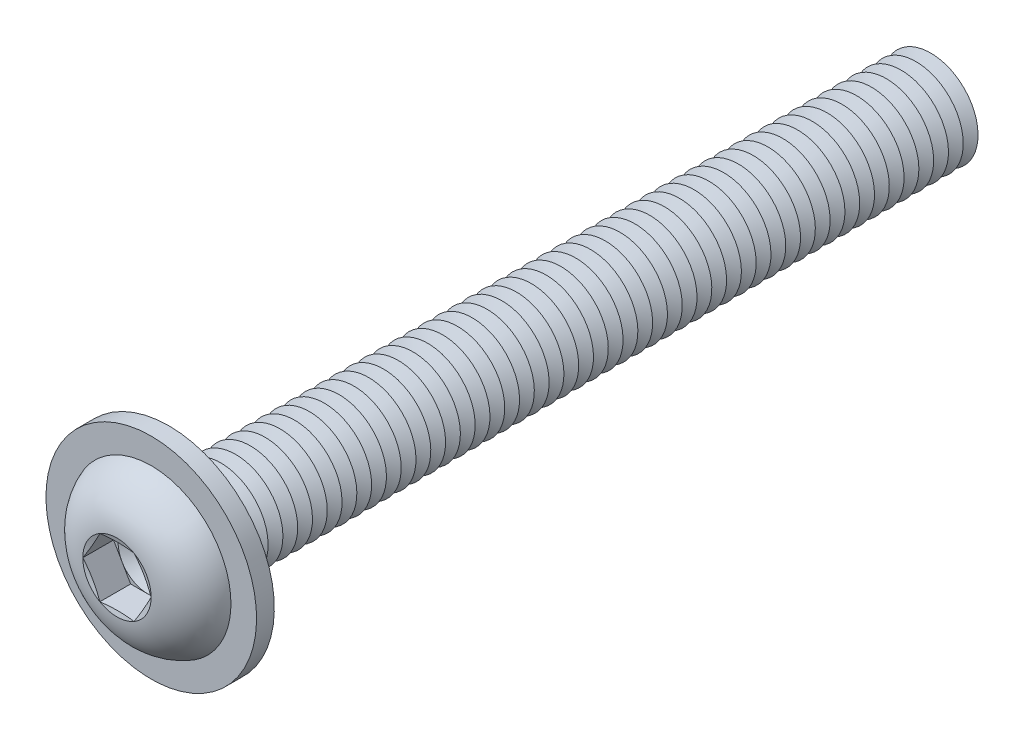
from build123d import *

# Parameters (mm, degrees)
FILLET1_R           = 0.625
LPATTERN1_COUNT     = 52
LPATTERN1_PITCH     = 1.25
CUT_EXTRUDE1_DEPTH  = 2.6
SKETCH5_R           = 8.9
SKETCH5_R_2         = 4.625
BOSS_EXTRUDE1_DEPTH = 1.5


with BuildPart() as part:
    # Sketch1 → Revolve1 (revolve)
    with BuildSketch(Plane(origin=(0, 0, 0), x_dir=(0, 0, -1), z_dir=(1, 0, 0))):
        with BuildLine():
            Line((0, 4), (0, 7))
            ThreePointArc((0, 7), (-3.011595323, 5.81154966), (-4.4, 2.88675))
            Line((-4.4, 2.88675), (-4.013248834, 1.443375))
            Line((-4.013248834, 1.443375), (-4.4, 1.443375))
            Line((-4.4, 1.443375), (-4.4, 0))
            Line((-4.4, 0), (65, 0))
            Line((65, 0), (65, 4))
            Line((65, 4), (0, 4))
        make_face()
    revolve(axis=Axis((0, 0, -65), (0, 0, 1)))

    # Fillet1
    fillet1_edges = [part.edges().sort_by_distance(p)[0] for p in [
        (0, -4, 0),
    ]]
    fillet(fillet1_edges, radius=FILLET1_R)

    # Sketch2 → Cut-Revolve1 (revolve, cut)
    with BuildSketch(Plane(origin=(0, 0, 0), x_dir=(0, 0, -1), z_dir=(1, 0, 0))):
        Polygon((64.375, 4), (65.625, 4), (65, 2.917468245), align=None)
    cut_revolve1 = revolve(axis=Axis((0, 0, -65), (0, 0, -1)), mode=Mode.SUBTRACT)

    # LPattern1: Cut-Revolve1 ×52
    with Locations(*[(0, 0, i * LPATTERN1_PITCH) for i in range(1, LPATTERN1_COUNT)]):
        add(cut_revolve1, mode=Mode.SUBTRACT)

    # Sketch3 → Cut-Extrude1 (cut)
    with BuildSketch(Plane.XY.offset(4.4)):
        Polygon((1.443375, 2.499998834), (-1.443375, 2.499998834), (-2.88675, 0), (-1.443375, -2.499998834), (1.443375, -2.499998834), (2.88675, 0), align=None)
    extrude(amount=-CUT_EXTRUDE1_DEPTH, mode=Mode.SUBTRACT)

    # Cut-Extrude2 cone 1 section (on through the dimple's axis) → Cut-Extrude2 (revolve, cut)
    with BuildSketch(Plane(origin=(0, 0, 1.8), x_dir=(0, -1, 0), z_dir=(1, 0, 0))):
        Polygon((0, 0), (2.499998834, 0), (0, 1.443375), align=None)
    revolve(axis=Axis((0, 0, 1.8), (0, 0, -1)), mode=Mode.SUBTRACT)

    # Sketch5 → Boss-Extrude1 (add)
    with BuildSketch(Plane(origin=(0, 0, 0), x_dir=(-1, 0, 0), z_dir=(0, 0, -1))):
        with Locations(Location((0, 0, 0), (0, 0, 90))):
            Circle(SKETCH5_R)
        Circle(SKETCH5_R_2, mode=Mode.SUBTRACT)
    extrude(amount=-BOSS_EXTRUDE1_DEPTH)


solid = part.part
